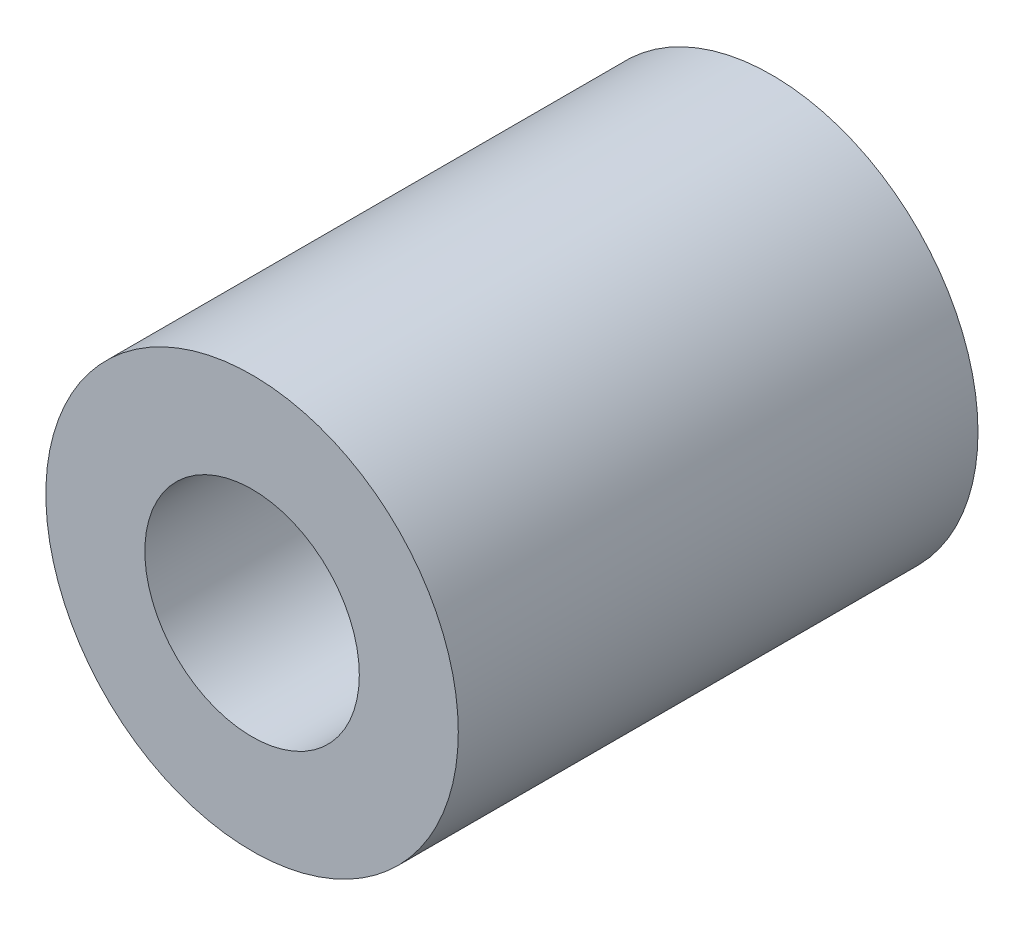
ISO-10303-21;
HEADER;
FILE_DESCRIPTION(('STEP AP214'),'2;1');
FILE_NAME('part.step','',(''),(''),'','','');
FILE_SCHEMA(('AUTOMOTIVE_DESIGN { 1 0 10303 214 1 1 1 1 }'));
ENDSEC;
DATA;
#1=APPLICATION_CONTEXT('core data for automotive mechanical design processes');
#2=APPLICATION_PROTOCOL_DEFINITION('international standard','automotive_design',2000,#1);
#3=PRODUCT_CONTEXT('',#1,'mechanical');
#4=PRODUCT('Part','Part','',(#3));
#5=PRODUCT_RELATED_PRODUCT_CATEGORY('part','',(#4));
#6=PRODUCT_DEFINITION_FORMATION('','',#4);
#7=PRODUCT_DEFINITION_CONTEXT('part definition',#1,'design');
#8=PRODUCT_DEFINITION('design','',#6,#7);
#9=PRODUCT_DEFINITION_SHAPE('','',#8);
#10=(LENGTH_UNIT() NAMED_UNIT(*) SI_UNIT(.MILLI.,.METRE.));
#11=(NAMED_UNIT(*) PLANE_ANGLE_UNIT() SI_UNIT($,.RADIAN.));
#12=(NAMED_UNIT(*) SI_UNIT($,.STERADIAN.) SOLID_ANGLE_UNIT());
#13=UNCERTAINTY_MEASURE_WITH_UNIT(LENGTH_MEASURE(1.E-05),#10,'distance_accuracy_value','');
#14=(GEOMETRIC_REPRESENTATION_CONTEXT(3) GLOBAL_UNCERTAINTY_ASSIGNED_CONTEXT((#13)) GLOBAL_UNIT_ASSIGNED_CONTEXT((#10,
#11,#12)) REPRESENTATION_CONTEXT('',''));
#15=CARTESIAN_POINT('',(0.,0.,0.));
#16=DIRECTION('',(0.,0.,1.));
#17=DIRECTION('',(1.,0.,0.));
#18=AXIS2_PLACEMENT_3D('',#15,#16,#17);
#19=CARTESIAN_POINT('',(13.,0.,15.));
#20=DIRECTION('',(0.,0.,-1.));
#21=DIRECTION('',(-1.,0.,0.));
#22=AXIS2_PLACEMENT_3D('',#19,#20,#21);
#23=PLANE('',#22);
#24=CARTESIAN_POINT('',(0.,0.,15.));
#25=DIRECTION('',(0.,0.,1.));
#26=DIRECTION('',(1.,0.,0.));
#27=AXIS2_PLACEMENT_3D('',#24,#25,#26);
#28=CIRCLE('',#27,9.);
#29=CARTESIAN_POINT('',(9.,0.,15.));
#30=VERTEX_POINT('',#29);
#31=EDGE_CURVE('E8',#30,#30,#28,.T.);
#32=ORIENTED_EDGE('',*,*,#31,.F.);
#33=EDGE_LOOP('',(#32));
#34=FACE_BOUND('',#33,.T.);
#35=CARTESIAN_POINT('',(0.,0.,15.));
#36=DIRECTION('',(0.,0.,1.));
#37=DIRECTION('',(1.,0.,0.));
#38=AXIS2_PLACEMENT_3D('',#35,#36,#37);
#39=CIRCLE('',#38,13.);
#40=CARTESIAN_POINT('',(13.,0.,15.));
#41=VERTEX_POINT('',#40);
#42=EDGE_CURVE('E34',#41,#41,#39,.T.);
#43=ORIENTED_EDGE('',*,*,#42,.T.);
#44=EDGE_LOOP('',(#43));
#45=FACE_BOUND('',#44,.T.);
#46=ADVANCED_FACE('F12',(#34,#45),#23,.F.);
#47=CARTESIAN_POINT('',(0.,0.,40.));
#48=DIRECTION('',(0.,0.,1.));
#49=DIRECTION('',(1.,0.,0.));
#50=AXIS2_PLACEMENT_3D('',#47,#48,#49);
#51=CYLINDRICAL_SURFACE('',#50,9.);
#52=CARTESIAN_POINT('',(0.,0.,0.));
#53=DIRECTION('',(0.,0.,1.));
#54=DIRECTION('',(1.,0.,0.));
#55=AXIS2_PLACEMENT_3D('',#52,#53,#54);
#56=CIRCLE('',#55,9.);
#57=CARTESIAN_POINT('',(9.,0.,0.));
#58=VERTEX_POINT('',#57);
#59=EDGE_CURVE('E18',#58,#58,#56,.T.);
#60=ORIENTED_EDGE('',*,*,#59,.F.);
#61=EDGE_LOOP('',(#60));
#62=FACE_BOUND('',#61,.T.);
#63=ORIENTED_EDGE('',*,*,#31,.T.);
#64=EDGE_LOOP('',(#63));
#65=FACE_BOUND('',#64,.T.);
#66=ADVANCED_FACE('F59',(#62,#65),#51,.F.);
#67=CARTESIAN_POINT('',(9.,0.,0.));
#68=DIRECTION('',(0.,0.,1.));
#69=DIRECTION('',(1.,0.,0.));
#70=AXIS2_PLACEMENT_3D('',#67,#68,#69);
#71=PLANE('',#70);
#72=CARTESIAN_POINT('',(0.,0.,0.));
#73=DIRECTION('',(0.,0.,1.));
#74=DIRECTION('',(1.,0.,0.));
#75=AXIS2_PLACEMENT_3D('',#72,#73,#74);
#76=CIRCLE('',#75,25.);
#77=CARTESIAN_POINT('',(25.,0.,0.));
#78=VERTEX_POINT('',#77);
#79=EDGE_CURVE('E22',#78,#78,#76,.T.);
#80=ORIENTED_EDGE('',*,*,#79,.F.);
#81=EDGE_LOOP('',(#80));
#82=FACE_BOUND('',#81,.T.);
#83=ORIENTED_EDGE('',*,*,#59,.T.);
#84=EDGE_LOOP('',(#83));
#85=FACE_BOUND('',#84,.T.);
#86=ADVANCED_FACE('F54',(#82,#85),#71,.F.);
#87=CARTESIAN_POINT('',(0.,0.,40.));
#88=DIRECTION('',(0.,0.,1.));
#89=DIRECTION('',(1.,0.,0.));
#90=AXIS2_PLACEMENT_3D('',#87,#88,#89);
#91=CYLINDRICAL_SURFACE('',#90,25.);
#92=CARTESIAN_POINT('',(0.,0.,63.));
#93=DIRECTION('',(0.,0.,1.));
#94=DIRECTION('',(1.,0.,0.));
#95=AXIS2_PLACEMENT_3D('',#92,#93,#94);
#96=CIRCLE('',#95,25.);
#97=CARTESIAN_POINT('',(25.,0.,63.));
#98=VERTEX_POINT('',#97);
#99=EDGE_CURVE('E26',#98,#98,#96,.T.);
#100=ORIENTED_EDGE('',*,*,#99,.F.);
#101=EDGE_LOOP('',(#100));
#102=FACE_BOUND('',#101,.T.);
#103=ORIENTED_EDGE('',*,*,#79,.T.);
#104=EDGE_LOOP('',(#103));
#105=FACE_BOUND('',#104,.T.);
#106=ADVANCED_FACE('F48',(#102,#105),#91,.T.);
#107=CARTESIAN_POINT('',(25.,0.,63.));
#108=DIRECTION('',(0.,0.,-1.));
#109=DIRECTION('',(-1.,0.,0.));
#110=AXIS2_PLACEMENT_3D('',#107,#108,#109);
#111=PLANE('',#110);
#112=CARTESIAN_POINT('',(0.,0.,63.));
#113=DIRECTION('',(0.,0.,1.));
#114=DIRECTION('',(1.,0.,0.));
#115=AXIS2_PLACEMENT_3D('',#112,#113,#114);
#116=CIRCLE('',#115,13.);
#117=CARTESIAN_POINT('',(13.,0.,63.));
#118=VERTEX_POINT('',#117);
#119=EDGE_CURVE('E31',#118,#118,#116,.T.);
#120=ORIENTED_EDGE('',*,*,#119,.F.);
#121=EDGE_LOOP('',(#120));
#122=FACE_BOUND('',#121,.T.);
#123=ORIENTED_EDGE('',*,*,#99,.T.);
#124=EDGE_LOOP('',(#123));
#125=FACE_BOUND('',#124,.T.);
#126=ADVANCED_FACE('F42',(#122,#125),#111,.F.);
#127=CARTESIAN_POINT('',(0.,0.,40.));
#128=DIRECTION('',(0.,0.,1.));
#129=DIRECTION('',(1.,0.,0.));
#130=AXIS2_PLACEMENT_3D('',#127,#128,#129);
#131=CYLINDRICAL_SURFACE('',#130,13.);
#132=ORIENTED_EDGE('',*,*,#42,.F.);
#133=EDGE_LOOP('',(#132));
#134=FACE_BOUND('',#133,.T.);
#135=ORIENTED_EDGE('',*,*,#119,.T.);
#136=EDGE_LOOP('',(#135));
#137=FACE_BOUND('',#136,.T.);
#138=ADVANCED_FACE('F39',(#134,#137),#131,.F.);
#139=CLOSED_SHELL('',(#46,#66,#86,#106,#126,#138));
#140=MANIFOLD_SOLID_BREP('B1',#139);
#141=ADVANCED_BREP_SHAPE_REPRESENTATION('',(#18,#140),#14);
#142=SHAPE_DEFINITION_REPRESENTATION(#9,#141);
ENDSEC;
END-ISO-10303-21;
